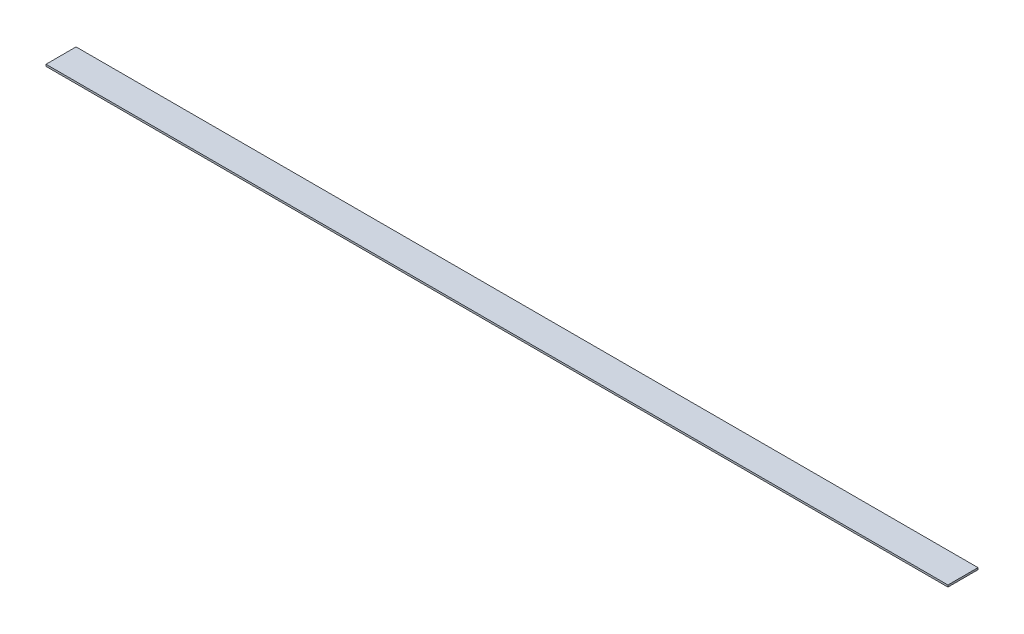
from build123d import *

# Parameters (mm, degrees)
SKETCH1_W           = 3048
SKETCH1_H           = 101.6
BOSS_EXTRUDE1_DEPTH = 6.35


with BuildPart() as part:
    # Sketch1 → Boss-Extrude1 (new body)
    with BuildSketch(Plane(origin=(0, 0, 0), x_dir=(1, 0, 0), z_dir=(0, 1, 0))):
        Rectangle(SKETCH1_W, SKETCH1_H)
    extrude(amount=BOSS_EXTRUDE1_DEPTH)


solid = part.part
